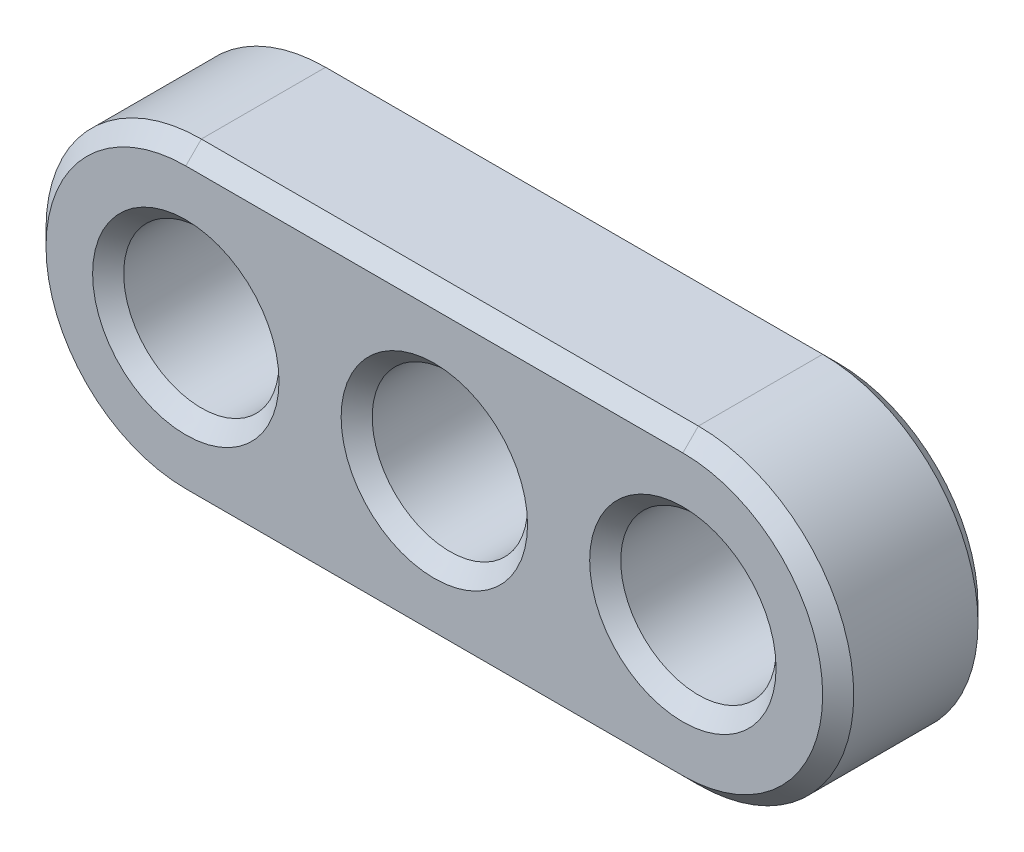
ISO-10303-21;
HEADER;
FILE_DESCRIPTION(('STEP AP214'),'2;1');
FILE_NAME('part.step','',(''),(''),'','','');
FILE_SCHEMA(('AUTOMOTIVE_DESIGN { 1 0 10303 214 1 1 1 1 }'));
ENDSEC;
DATA;
#1=APPLICATION_CONTEXT('core data for automotive mechanical design processes');
#2=APPLICATION_PROTOCOL_DEFINITION('international standard','automotive_design',2000,#1);
#3=PRODUCT_CONTEXT('',#1,'mechanical');
#4=PRODUCT('Part','Part','',(#3));
#5=PRODUCT_RELATED_PRODUCT_CATEGORY('part','',(#4));
#6=PRODUCT_DEFINITION_FORMATION('','',#4);
#7=PRODUCT_DEFINITION_CONTEXT('part definition',#1,'design');
#8=PRODUCT_DEFINITION('design','',#6,#7);
#9=PRODUCT_DEFINITION_SHAPE('','',#8);
#10=(LENGTH_UNIT() NAMED_UNIT(*) SI_UNIT(.MILLI.,.METRE.));
#11=(NAMED_UNIT(*) PLANE_ANGLE_UNIT() SI_UNIT($,.RADIAN.));
#12=(NAMED_UNIT(*) SI_UNIT($,.STERADIAN.) SOLID_ANGLE_UNIT());
#13=UNCERTAINTY_MEASURE_WITH_UNIT(LENGTH_MEASURE(1.E-05),#10,'distance_accuracy_value','');
#14=(GEOMETRIC_REPRESENTATION_CONTEXT(3) GLOBAL_UNCERTAINTY_ASSIGNED_CONTEXT((#13)) GLOBAL_UNIT_ASSIGNED_CONTEXT((#10,
#11,#12)) REPRESENTATION_CONTEXT('',''));
#15=CARTESIAN_POINT('',(0.,0.,0.));
#16=DIRECTION('',(0.,0.,1.));
#17=DIRECTION('',(1.,0.,0.));
#18=AXIS2_PLACEMENT_3D('',#15,#16,#17);
#19=CARTESIAN_POINT('',(12.,0.,7.5));
#20=DIRECTION('',(0.,0.,1.));
#21=DIRECTION('',(1.,0.,0.));
#22=AXIS2_PLACEMENT_3D('',#19,#20,#21);
#23=PLANE('',#22);
#24=CARTESIAN_POINT('',(12.,0.,7.5));
#25=DIRECTION('',(0.,0.,1.));
#26=DIRECTION('',(1.,0.,0.));
#27=AXIS2_PLACEMENT_3D('',#24,#25,#26);
#28=CIRCLE('',#27,4.5);
#29=CARTESIAN_POINT('',(16.5,0.,7.5));
#30=VERTEX_POINT('',#29);
#31=EDGE_CURVE('E11',#30,#30,#28,.F.);
#32=ORIENTED_EDGE('',*,*,#31,.T.);
#33=EDGE_LOOP('',(#32));
#34=FACE_BOUND('',#33,.T.);
#35=CARTESIAN_POINT('',(-12.,0.,7.5));
#36=DIRECTION('',(0.,0.,1.));
#37=DIRECTION('',(1.,0.,0.));
#38=AXIS2_PLACEMENT_3D('',#35,#36,#37);
#39=CIRCLE('',#38,4.5);
#40=CARTESIAN_POINT('',(-7.5,0.,7.5));
#41=VERTEX_POINT('',#40);
#42=EDGE_CURVE('E41',#41,#41,#39,.F.);
#43=ORIENTED_EDGE('',*,*,#42,.T.);
#44=EDGE_LOOP('',(#43));
#45=FACE_BOUND('',#44,.T.);
#46=CARTESIAN_POINT('',(-12.,0.,7.5));
#47=DIRECTION('',(0.,0.,1.));
#48=DIRECTION('',(1.,0.,0.));
#49=AXIS2_PLACEMENT_3D('',#46,#47,#48);
#50=CIRCLE('',#49,6.75);
#51=CARTESIAN_POINT('',(-12.,6.74999999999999,7.5));
#52=VERTEX_POINT('',#51);
#53=CARTESIAN_POINT('',(-12.,-6.75,7.5));
#54=VERTEX_POINT('',#53);
#55=EDGE_CURVE('E49',#52,#54,#50,.T.);
#56=ORIENTED_EDGE('',*,*,#55,.T.);
#57=DIRECTION('',(1.,0.,0.));
#58=VECTOR('',#57,1.);
#59=CARTESIAN_POINT('',(12.,-6.74999999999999,7.5));
#60=LINE('',#59,#58);
#61=CARTESIAN_POINT('',(12.,-6.75,7.5));
#62=VERTEX_POINT('',#61);
#63=EDGE_CURVE('E180',#54,#62,#60,.T.);
#64=ORIENTED_EDGE('',*,*,#63,.T.);
#65=CARTESIAN_POINT('',(12.,0.,7.5));
#66=DIRECTION('',(0.,0.,1.));
#67=DIRECTION('',(1.,0.,0.));
#68=AXIS2_PLACEMENT_3D('',#65,#66,#67);
#69=CIRCLE('',#68,6.75);
#70=CARTESIAN_POINT('',(12.,6.75,7.5));
#71=VERTEX_POINT('',#70);
#72=EDGE_CURVE('E176',#62,#71,#69,.T.);
#73=ORIENTED_EDGE('',*,*,#72,.T.);
#74=DIRECTION('',(-1.,0.,0.));
#75=VECTOR('',#74,1.);
#76=CARTESIAN_POINT('',(-12.,6.74999999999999,7.5));
#77=LINE('',#76,#75);
#78=EDGE_CURVE('E54',#71,#52,#77,.T.);
#79=ORIENTED_EDGE('',*,*,#78,.T.);
#80=EDGE_LOOP('',(#56,#64,#73,#79));
#81=FACE_BOUND('',#80,.T.);
#82=CARTESIAN_POINT('',(0.,0.,7.5));
#83=DIRECTION('',(0.,0.,1.));
#84=DIRECTION('',(1.,0.,0.));
#85=AXIS2_PLACEMENT_3D('',#82,#83,#84);
#86=CIRCLE('',#85,4.5);
#87=CARTESIAN_POINT('',(4.5,0.,7.5));
#88=VERTEX_POINT('',#87);
#89=EDGE_CURVE('E173',#88,#88,#86,.F.);
#90=ORIENTED_EDGE('',*,*,#89,.T.);
#91=EDGE_LOOP('',(#90));
#92=FACE_BOUND('',#91,.T.);
#93=ADVANCED_FACE('F32',(#34,#45,#81,#92),#23,.T.);
#94=CARTESIAN_POINT('',(12.,0.,0.));
#95=DIRECTION('',(0.,0.,1.));
#96=DIRECTION('',(1.,0.,0.));
#97=AXIS2_PLACEMENT_3D('',#94,#95,#96);
#98=PLANE('',#97);
#99=CARTESIAN_POINT('',(12.,0.,0.));
#100=DIRECTION('',(0.,0.,1.));
#101=DIRECTION('',(1.,0.,0.));
#102=AXIS2_PLACEMENT_3D('',#99,#100,#101);
#103=CIRCLE('',#102,4.5);
#104=CARTESIAN_POINT('',(16.5,0.,0.));
#105=VERTEX_POINT('',#104);
#106=EDGE_CURVE('E136',#105,#105,#103,.T.);
#107=ORIENTED_EDGE('',*,*,#106,.T.);
#108=EDGE_LOOP('',(#107));
#109=FACE_BOUND('',#108,.T.);
#110=CARTESIAN_POINT('',(0.,0.,0.));
#111=DIRECTION('',(0.,0.,1.));
#112=DIRECTION('',(1.,0.,0.));
#113=AXIS2_PLACEMENT_3D('',#110,#111,#112);
#114=CIRCLE('',#113,4.50000000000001);
#115=CARTESIAN_POINT('',(4.50000000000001,0.,0.));
#116=VERTEX_POINT('',#115);
#117=EDGE_CURVE('E129',#116,#116,#114,.T.);
#118=ORIENTED_EDGE('',*,*,#117,.T.);
#119=EDGE_LOOP('',(#118));
#120=FACE_BOUND('',#119,.T.);
#121=CARTESIAN_POINT('',(-12.,0.,0.));
#122=DIRECTION('',(0.,0.,1.));
#123=DIRECTION('',(1.,0.,0.));
#124=AXIS2_PLACEMENT_3D('',#121,#122,#123);
#125=CIRCLE('',#124,4.5);
#126=CARTESIAN_POINT('',(-7.5,0.,0.));
#127=VERTEX_POINT('',#126);
#128=EDGE_CURVE('E126',#127,#127,#125,.T.);
#129=ORIENTED_EDGE('',*,*,#128,.T.);
#130=EDGE_LOOP('',(#129));
#131=FACE_BOUND('',#130,.T.);
#132=CARTESIAN_POINT('',(-12.,0.,0.));
#133=DIRECTION('',(0.,0.,1.));
#134=DIRECTION('',(1.,0.,0.));
#135=AXIS2_PLACEMENT_3D('',#132,#133,#134);
#136=CIRCLE('',#135,6.74999999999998);
#137=CARTESIAN_POINT('',(-12.,-6.74999999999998,0.));
#138=VERTEX_POINT('',#137);
#139=CARTESIAN_POINT('',(-12.,6.74999999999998,0.));
#140=VERTEX_POINT('',#139);
#141=EDGE_CURVE('E125',#138,#140,#136,.F.);
#142=ORIENTED_EDGE('',*,*,#141,.T.);
#143=DIRECTION('',(1.,0.,0.));
#144=VECTOR('',#143,1.);
#145=CARTESIAN_POINT('',(12.,6.74999999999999,0.));
#146=LINE('',#145,#144);
#147=CARTESIAN_POINT('',(12.,6.74999999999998,0.));
#148=VERTEX_POINT('',#147);
#149=EDGE_CURVE('E104',#140,#148,#146,.T.);
#150=ORIENTED_EDGE('',*,*,#149,.T.);
#151=CARTESIAN_POINT('',(12.,0.,0.));
#152=DIRECTION('',(0.,0.,1.));
#153=DIRECTION('',(1.,0.,0.));
#154=AXIS2_PLACEMENT_3D('',#151,#152,#153);
#155=CIRCLE('',#154,6.74999999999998);
#156=CARTESIAN_POINT('',(12.,-6.74999999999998,0.));
#157=VERTEX_POINT('',#156);
#158=EDGE_CURVE('E114',#148,#157,#155,.F.);
#159=ORIENTED_EDGE('',*,*,#158,.T.);
#160=DIRECTION('',(-1.,0.,0.));
#161=VECTOR('',#160,1.);
#162=CARTESIAN_POINT('',(12.,-6.74999999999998,0.));
#163=LINE('',#162,#161);
#164=EDGE_CURVE('E120',#157,#138,#163,.T.);
#165=ORIENTED_EDGE('',*,*,#164,.T.);
#166=EDGE_LOOP('',(#142,#150,#159,#165));
#167=FACE_BOUND('',#166,.T.);
#168=ADVANCED_FACE('F123',(#109,#120,#131,#167),#98,.F.);
#169=CARTESIAN_POINT('',(12.,0.,7.5));
#170=DIRECTION('',(0.,0.,-1.));
#171=DIRECTION('',(-1.,0.,0.));
#172=AXIS2_PLACEMENT_3D('',#169,#170,#171);
#173=CYLINDRICAL_SURFACE('',#172,7.5);
#174=DIRECTION('',(0.,0.,-1.));
#175=VECTOR('',#174,1.);
#176=CARTESIAN_POINT('',(12.,-7.49999999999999,7.5));
#177=LINE('',#176,#175);
#178=CARTESIAN_POINT('',(12.,-7.49999999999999,6.75));
#179=VERTEX_POINT('',#178);
#180=CARTESIAN_POINT('',(12.,-7.49999999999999,0.750000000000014));
#181=VERTEX_POINT('',#180);
#182=EDGE_CURVE('E188',#179,#181,#177,.T.);
#183=ORIENTED_EDGE('',*,*,#182,.T.);
#184=CARTESIAN_POINT('',(12.,0.,0.750000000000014));
#185=DIRECTION('',(0.,0.,1.));
#186=DIRECTION('',(1.,0.,0.));
#187=AXIS2_PLACEMENT_3D('',#184,#185,#186);
#188=CIRCLE('',#187,7.5);
#189=CARTESIAN_POINT('',(12.,7.5,0.750000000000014));
#190=VERTEX_POINT('',#189);
#191=EDGE_CURVE('E171',#181,#190,#188,.T.);
#192=ORIENTED_EDGE('',*,*,#191,.T.);
#193=DIRECTION('',(0.,0.,-1.));
#194=VECTOR('',#193,1.);
#195=CARTESIAN_POINT('',(12.,7.5,7.5));
#196=LINE('',#195,#194);
#197=CARTESIAN_POINT('',(12.,7.5,6.75));
#198=VERTEX_POINT('',#197);
#199=EDGE_CURVE('E121',#198,#190,#196,.T.);
#200=ORIENTED_EDGE('',*,*,#199,.F.);
#201=CARTESIAN_POINT('',(12.,0.,6.75));
#202=DIRECTION('',(0.,0.,1.));
#203=DIRECTION('',(1.,0.,0.));
#204=AXIS2_PLACEMENT_3D('',#201,#202,#203);
#205=CIRCLE('',#204,7.5);
#206=EDGE_CURVE('E169',#198,#179,#205,.F.);
#207=ORIENTED_EDGE('',*,*,#206,.T.);
#208=EDGE_LOOP('',(#183,#192,#200,#207));
#209=FACE_BOUND('',#208,.T.);
#210=ADVANCED_FACE('F214',(#209),#173,.T.);
#211=CARTESIAN_POINT('',(12.,7.5,7.5));
#212=DIRECTION('',(0.,-1.,0.));
#213=DIRECTION('',(1.,0.,0.));
#214=AXIS2_PLACEMENT_3D('',#211,#212,#213);
#215=PLANE('',#214);
#216=ORIENTED_EDGE('',*,*,#199,.T.);
#217=DIRECTION('',(-1.,0.,0.));
#218=VECTOR('',#217,1.);
#219=CARTESIAN_POINT('',(12.,7.5,0.750000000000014));
#220=LINE('',#219,#218);
#221=CARTESIAN_POINT('',(-12.,7.5,0.750000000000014));
#222=VERTEX_POINT('',#221);
#223=EDGE_CURVE('E107',#190,#222,#220,.T.);
#224=ORIENTED_EDGE('',*,*,#223,.T.);
#225=DIRECTION('',(0.,0.,-1.));
#226=VECTOR('',#225,1.);
#227=CARTESIAN_POINT('',(-12.,7.5,7.5));
#228=LINE('',#227,#226);
#229=CARTESIAN_POINT('',(-12.,7.5,6.75));
#230=VERTEX_POINT('',#229);
#231=EDGE_CURVE('E211',#230,#222,#228,.T.);
#232=ORIENTED_EDGE('',*,*,#231,.F.);
#233=DIRECTION('',(1.,0.,0.));
#234=VECTOR('',#233,1.);
#235=CARTESIAN_POINT('',(12.,7.5,6.75));
#236=LINE('',#235,#234);
#237=EDGE_CURVE('E157',#230,#198,#236,.T.);
#238=ORIENTED_EDGE('',*,*,#237,.T.);
#239=EDGE_LOOP('',(#216,#224,#232,#238));
#240=FACE_BOUND('',#239,.T.);
#241=ADVANCED_FACE('F209',(#240),#215,.F.);
#242=CARTESIAN_POINT('',(-12.,0.,7.5));
#243=DIRECTION('',(0.,0.,-1.));
#244=DIRECTION('',(-1.,0.,0.));
#245=AXIS2_PLACEMENT_3D('',#242,#243,#244);
#246=CYLINDRICAL_SURFACE('',#245,7.5);
#247=ORIENTED_EDGE('',*,*,#231,.T.);
#248=CARTESIAN_POINT('',(-12.,0.,0.750000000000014));
#249=DIRECTION('',(0.,0.,1.));
#250=DIRECTION('',(1.,0.,0.));
#251=AXIS2_PLACEMENT_3D('',#248,#249,#250);
#252=CIRCLE('',#251,7.5);
#253=CARTESIAN_POINT('',(-12.,-7.5,0.750000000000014));
#254=VERTEX_POINT('',#253);
#255=EDGE_CURVE('E162',#222,#254,#252,.T.);
#256=ORIENTED_EDGE('',*,*,#255,.T.);
#257=DIRECTION('',(0.,0.,-1.));
#258=VECTOR('',#257,1.);
#259=CARTESIAN_POINT('',(-12.,-7.5,7.5));
#260=LINE('',#259,#258);
#261=CARTESIAN_POINT('',(-12.,-7.5,6.75));
#262=VERTEX_POINT('',#261);
#263=EDGE_CURVE('E217',#262,#254,#260,.T.);
#264=ORIENTED_EDGE('',*,*,#263,.F.);
#265=CARTESIAN_POINT('',(-12.,0.,6.75));
#266=DIRECTION('',(0.,0.,1.));
#267=DIRECTION('',(1.,0.,0.));
#268=AXIS2_PLACEMENT_3D('',#265,#266,#267);
#269=CIRCLE('',#268,7.5);
#270=EDGE_CURVE('E160',#262,#230,#269,.F.);
#271=ORIENTED_EDGE('',*,*,#270,.T.);
#272=EDGE_LOOP('',(#247,#256,#264,#271));
#273=FACE_BOUND('',#272,.T.);
#274=ADVANCED_FACE('F230',(#273),#246,.T.);
#275=CARTESIAN_POINT('',(12.,-7.49999999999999,7.5));
#276=DIRECTION('',(0.,1.,0.));
#277=DIRECTION('',(-1.,0.,0.));
#278=AXIS2_PLACEMENT_3D('',#275,#276,#277);
#279=PLANE('',#278);
#280=ORIENTED_EDGE('',*,*,#263,.T.);
#281=DIRECTION('',(1.,0.,0.));
#282=VECTOR('',#281,1.);
#283=CARTESIAN_POINT('',(12.,-7.49999999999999,0.750000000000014));
#284=LINE('',#283,#282);
#285=EDGE_CURVE('E167',#254,#181,#284,.T.);
#286=ORIENTED_EDGE('',*,*,#285,.T.);
#287=ORIENTED_EDGE('',*,*,#182,.F.);
#288=DIRECTION('',(-1.,0.,0.));
#289=VECTOR('',#288,1.);
#290=CARTESIAN_POINT('',(-12.,-7.5,6.75));
#291=LINE('',#290,#289);
#292=EDGE_CURVE('E164',#179,#262,#291,.T.);
#293=ORIENTED_EDGE('',*,*,#292,.T.);
#294=EDGE_LOOP('',(#280,#286,#287,#293));
#295=FACE_BOUND('',#294,.T.);
#296=ADVANCED_FACE('F234',(#295),#279,.F.);
#297=CARTESIAN_POINT('',(-12.,0.,7.5));
#298=DIRECTION('',(0.,0.,-1.));
#299=DIRECTION('',(-1.,0.,0.));
#300=AXIS2_PLACEMENT_3D('',#297,#298,#299);
#301=CYLINDRICAL_SURFACE('',#300,3.75);
#302=CARTESIAN_POINT('',(-12.,0.,0.750000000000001));
#303=DIRECTION('',(0.,0.,1.));
#304=DIRECTION('',(1.,0.,0.));
#305=AXIS2_PLACEMENT_3D('',#302,#303,#304);
#306=CIRCLE('',#305,3.75);
#307=CARTESIAN_POINT('',(-8.25,0.,0.750000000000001));
#308=VERTEX_POINT('',#307);
#309=EDGE_CURVE('E154',#308,#308,#306,.F.);
#310=ORIENTED_EDGE('',*,*,#309,.T.);
#311=EDGE_LOOP('',(#310));
#312=FACE_BOUND('',#311,.T.);
#313=CARTESIAN_POINT('',(-12.,0.,6.75));
#314=DIRECTION('',(0.,0.,1.));
#315=DIRECTION('',(1.,0.,0.));
#316=AXIS2_PLACEMENT_3D('',#313,#314,#315);
#317=CIRCLE('',#316,3.75);
#318=CARTESIAN_POINT('',(-8.25,0.,6.75));
#319=VERTEX_POINT('',#318);
#320=EDGE_CURVE('E151',#319,#319,#317,.T.);
#321=ORIENTED_EDGE('',*,*,#320,.T.);
#322=EDGE_LOOP('',(#321));
#323=FACE_BOUND('',#322,.T.);
#324=ADVANCED_FACE('F253',(#312,#323),#301,.F.);
#325=CARTESIAN_POINT('',(0.,0.,7.5));
#326=DIRECTION('',(0.,0.,-1.));
#327=DIRECTION('',(-1.,0.,0.));
#328=AXIS2_PLACEMENT_3D('',#325,#326,#327);
#329=CYLINDRICAL_SURFACE('',#328,3.75);
#330=CARTESIAN_POINT('',(0.,0.,0.750000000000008));
#331=DIRECTION('',(0.,0.,1.));
#332=DIRECTION('',(1.,0.,0.));
#333=AXIS2_PLACEMENT_3D('',#330,#331,#332);
#334=CIRCLE('',#333,3.75);
#335=CARTESIAN_POINT('',(3.75,0.,0.750000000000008));
#336=VERTEX_POINT('',#335);
#337=EDGE_CURVE('E148',#336,#336,#334,.F.);
#338=ORIENTED_EDGE('',*,*,#337,.T.);
#339=EDGE_LOOP('',(#338));
#340=FACE_BOUND('',#339,.T.);
#341=CARTESIAN_POINT('',(0.,0.,6.75));
#342=DIRECTION('',(0.,0.,1.));
#343=DIRECTION('',(1.,0.,0.));
#344=AXIS2_PLACEMENT_3D('',#341,#342,#343);
#345=CIRCLE('',#344,3.75);
#346=CARTESIAN_POINT('',(3.75,0.,6.75));
#347=VERTEX_POINT('',#346);
#348=EDGE_CURVE('E145',#347,#347,#345,.T.);
#349=ORIENTED_EDGE('',*,*,#348,.T.);
#350=EDGE_LOOP('',(#349));
#351=FACE_BOUND('',#350,.T.);
#352=ADVANCED_FACE('F250',(#340,#351),#329,.F.);
#353=CARTESIAN_POINT('',(12.,0.,7.5));
#354=DIRECTION('',(0.,0.,-1.));
#355=DIRECTION('',(-1.,0.,0.));
#356=AXIS2_PLACEMENT_3D('',#353,#354,#355);
#357=CYLINDRICAL_SURFACE('',#356,3.75);
#358=CARTESIAN_POINT('',(12.,0.,0.750000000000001));
#359=DIRECTION('',(0.,0.,1.));
#360=DIRECTION('',(1.,0.,0.));
#361=AXIS2_PLACEMENT_3D('',#358,#359,#360);
#362=CIRCLE('',#361,3.75);
#363=CARTESIAN_POINT('',(15.75,0.,0.750000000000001));
#364=VERTEX_POINT('',#363);
#365=EDGE_CURVE('E142',#364,#364,#362,.F.);
#366=ORIENTED_EDGE('',*,*,#365,.T.);
#367=EDGE_LOOP('',(#366));
#368=FACE_BOUND('',#367,.T.);
#369=CARTESIAN_POINT('',(12.,0.,6.75));
#370=DIRECTION('',(0.,0.,1.));
#371=DIRECTION('',(1.,0.,0.));
#372=AXIS2_PLACEMENT_3D('',#369,#370,#371);
#373=CIRCLE('',#372,3.75);
#374=CARTESIAN_POINT('',(15.75,0.,6.75));
#375=VERTEX_POINT('',#374);
#376=EDGE_CURVE('E139',#375,#375,#373,.T.);
#377=ORIENTED_EDGE('',*,*,#376,.T.);
#378=EDGE_LOOP('',(#377));
#379=FACE_BOUND('',#378,.T.);
#380=ADVANCED_FACE('F252',(#368,#379),#357,.F.);
#381=CARTESIAN_POINT('',(12.,0.,0.));
#382=DIRECTION('',(0.,0.,-1.));
#383=DIRECTION('',(-1.,0.,0.));
#384=AXIS2_PLACEMENT_3D('',#381,#382,#383);
#385=CONICAL_SURFACE('',#384,4.5,0.785398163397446);
#386=ORIENTED_EDGE('',*,*,#365,.F.);
#387=EDGE_LOOP('',(#386));
#388=FACE_BOUND('',#387,.T.);
#389=ORIENTED_EDGE('',*,*,#106,.F.);
#390=EDGE_LOOP('',(#389));
#391=FACE_BOUND('',#390,.T.);
#392=ADVANCED_FACE('F260',(#388,#391),#385,.F.);
#393=CARTESIAN_POINT('',(0.,0.,0.));
#394=DIRECTION('',(0.,0.,-1.));
#395=DIRECTION('',(-1.,0.,0.));
#396=AXIS2_PLACEMENT_3D('',#393,#394,#395);
#397=CONICAL_SURFACE('',#396,4.50000000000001,0.785398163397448);
#398=ORIENTED_EDGE('',*,*,#337,.F.);
#399=EDGE_LOOP('',(#398));
#400=FACE_BOUND('',#399,.T.);
#401=ORIENTED_EDGE('',*,*,#117,.F.);
#402=EDGE_LOOP('',(#401));
#403=FACE_BOUND('',#402,.T.);
#404=ADVANCED_FACE('F279',(#400,#403),#397,.F.);
#405=CARTESIAN_POINT('',(-12.,0.,0.));
#406=DIRECTION('',(0.,0.,-1.));
#407=DIRECTION('',(-1.,0.,0.));
#408=AXIS2_PLACEMENT_3D('',#405,#406,#407);
#409=CONICAL_SURFACE('',#408,4.5,0.785398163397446);
#410=ORIENTED_EDGE('',*,*,#309,.F.);
#411=EDGE_LOOP('',(#410));
#412=FACE_BOUND('',#411,.T.);
#413=ORIENTED_EDGE('',*,*,#128,.F.);
#414=EDGE_LOOP('',(#413));
#415=FACE_BOUND('',#414,.T.);
#416=ADVANCED_FACE('F283',(#412,#415),#409,.F.);
#417=CARTESIAN_POINT('',(12.,-7.49999999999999,0.750000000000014));
#418=DIRECTION('',(0.,0.707106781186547,0.707106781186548));
#419=DIRECTION('',(1.,0.,0.));
#420=AXIS2_PLACEMENT_3D('',#417,#418,#419);
#421=PLANE('',#420);
#422=DIRECTION('',(0.,-0.707106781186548,0.707106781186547));
#423=VECTOR('',#422,1.);
#424=CARTESIAN_POINT('',(-12.,-6.74999999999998,0.));
#425=LINE('',#424,#423);
#426=EDGE_CURVE('E110',#138,#254,#425,.T.);
#427=ORIENTED_EDGE('',*,*,#426,.F.);
#428=ORIENTED_EDGE('',*,*,#164,.F.);
#429=DIRECTION('',(0.,0.707106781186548,-0.707106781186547));
#430=VECTOR('',#429,1.);
#431=CARTESIAN_POINT('',(12.,-7.49999999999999,0.750000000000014));
#432=LINE('',#431,#430);
#433=EDGE_CURVE('E117',#181,#157,#432,.T.);
#434=ORIENTED_EDGE('',*,*,#433,.F.);
#435=ORIENTED_EDGE('',*,*,#285,.F.);
#436=EDGE_LOOP('',(#427,#428,#434,#435));
#437=FACE_BOUND('',#436,.T.);
#438=ADVANCED_FACE('F223',(#437),#421,.F.);
#439=CARTESIAN_POINT('',(12.,0.,0.750000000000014));
#440=DIRECTION('',(0.,0.,1.));
#441=DIRECTION('',(1.,0.,0.));
#442=AXIS2_PLACEMENT_3D('',#439,#440,#441);
#443=CONICAL_SURFACE('',#442,7.5,0.785398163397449);
#444=ORIENTED_EDGE('',*,*,#433,.T.);
#445=ORIENTED_EDGE('',*,*,#158,.F.);
#446=DIRECTION('',(0.,-0.707106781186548,-0.707106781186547));
#447=VECTOR('',#446,1.);
#448=CARTESIAN_POINT('',(12.,7.5,0.750000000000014));
#449=LINE('',#448,#447);
#450=EDGE_CURVE('E100',#190,#148,#449,.T.);
#451=ORIENTED_EDGE('',*,*,#450,.F.);
#452=ORIENTED_EDGE('',*,*,#191,.F.);
#453=EDGE_LOOP('',(#444,#445,#451,#452));
#454=FACE_BOUND('',#453,.T.);
#455=ADVANCED_FACE('F115',(#454),#443,.T.);
#456=CARTESIAN_POINT('',(-12.,0.,0.750000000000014));
#457=DIRECTION('',(0.,0.,1.));
#458=DIRECTION('',(1.,0.,0.));
#459=AXIS2_PLACEMENT_3D('',#456,#457,#458);
#460=CONICAL_SURFACE('',#459,7.5,0.785398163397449);
#461=ORIENTED_EDGE('',*,*,#426,.T.);
#462=ORIENTED_EDGE('',*,*,#255,.F.);
#463=DIRECTION('',(0.,0.707106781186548,0.707106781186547));
#464=VECTOR('',#463,1.);
#465=CARTESIAN_POINT('',(-12.,6.74999999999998,0.));
#466=LINE('',#465,#464);
#467=EDGE_CURVE('E111',#140,#222,#466,.T.);
#468=ORIENTED_EDGE('',*,*,#467,.F.);
#469=ORIENTED_EDGE('',*,*,#141,.F.);
#470=EDGE_LOOP('',(#461,#462,#468,#469));
#471=FACE_BOUND('',#470,.T.);
#472=ADVANCED_FACE('F226',(#471),#460,.T.);
#473=CARTESIAN_POINT('',(12.,7.5,0.750000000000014));
#474=DIRECTION('',(0.,-0.707106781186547,0.707106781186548));
#475=DIRECTION('',(-1.,0.,0.));
#476=AXIS2_PLACEMENT_3D('',#473,#474,#475);
#477=PLANE('',#476);
#478=ORIENTED_EDGE('',*,*,#450,.T.);
#479=ORIENTED_EDGE('',*,*,#149,.F.);
#480=ORIENTED_EDGE('',*,*,#467,.T.);
#481=ORIENTED_EDGE('',*,*,#223,.F.);
#482=EDGE_LOOP('',(#478,#479,#480,#481));
#483=FACE_BOUND('',#482,.T.);
#484=ADVANCED_FACE('F102',(#483),#477,.F.);
#485=CARTESIAN_POINT('',(12.,0.,6.75));
#486=DIRECTION('',(0.,0.,1.));
#487=DIRECTION('',(1.,0.,0.));
#488=AXIS2_PLACEMENT_3D('',#485,#486,#487);
#489=CONICAL_SURFACE('',#488,3.75,0.785398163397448);
#490=ORIENTED_EDGE('',*,*,#31,.F.);
#491=EDGE_LOOP('',(#490));
#492=FACE_BOUND('',#491,.T.);
#493=ORIENTED_EDGE('',*,*,#376,.F.);
#494=EDGE_LOOP('',(#493));
#495=FACE_BOUND('',#494,.T.);
#496=ADVANCED_FACE('F290',(#492,#495),#489,.F.);
#497=CARTESIAN_POINT('',(-12.,0.,6.75));
#498=DIRECTION('',(0.,0.,1.));
#499=DIRECTION('',(1.,0.,0.));
#500=AXIS2_PLACEMENT_3D('',#497,#498,#499);
#501=CONICAL_SURFACE('',#500,3.75,0.785398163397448);
#502=ORIENTED_EDGE('',*,*,#42,.F.);
#503=EDGE_LOOP('',(#502));
#504=FACE_BOUND('',#503,.T.);
#505=ORIENTED_EDGE('',*,*,#320,.F.);
#506=EDGE_LOOP('',(#505));
#507=FACE_BOUND('',#506,.T.);
#508=ADVANCED_FACE('F299',(#504,#507),#501,.F.);
#509=CARTESIAN_POINT('',(12.,6.75,7.5));
#510=DIRECTION('',(0.,0.707106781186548,0.707106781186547));
#511=DIRECTION('',(1.,0.,0.));
#512=AXIS2_PLACEMENT_3D('',#509,#510,#511);
#513=PLANE('',#512);
#514=DIRECTION('',(0.,-0.707106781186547,0.707106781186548));
#515=VECTOR('',#514,1.);
#516=CARTESIAN_POINT('',(12.,7.5,6.75));
#517=LINE('',#516,#515);
#518=EDGE_CURVE('E192',#198,#71,#517,.T.);
#519=ORIENTED_EDGE('',*,*,#518,.F.);
#520=ORIENTED_EDGE('',*,*,#237,.F.);
#521=DIRECTION('',(0.,0.707106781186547,-0.707106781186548));
#522=VECTOR('',#521,1.);
#523=CARTESIAN_POINT('',(-12.,6.74999999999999,7.5));
#524=LINE('',#523,#522);
#525=EDGE_CURVE('E36',#52,#230,#524,.T.);
#526=ORIENTED_EDGE('',*,*,#525,.F.);
#527=ORIENTED_EDGE('',*,*,#78,.F.);
#528=EDGE_LOOP('',(#519,#520,#526,#527));
#529=FACE_BOUND('',#528,.T.);
#530=ADVANCED_FACE('F204',(#529),#513,.T.);
#531=CARTESIAN_POINT('',(-12.,0.,7.5));
#532=DIRECTION('',(0.,0.,-1.));
#533=DIRECTION('',(-1.,0.,0.));
#534=AXIS2_PLACEMENT_3D('',#531,#532,#533);
#535=CONICAL_SURFACE('',#534,6.75,0.785398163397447);
#536=ORIENTED_EDGE('',*,*,#525,.T.);
#537=ORIENTED_EDGE('',*,*,#270,.F.);
#538=DIRECTION('',(0.,-0.707106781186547,-0.707106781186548));
#539=VECTOR('',#538,1.);
#540=CARTESIAN_POINT('',(-12.,-6.75,7.5));
#541=LINE('',#540,#539);
#542=EDGE_CURVE('E191',#54,#262,#541,.T.);
#543=ORIENTED_EDGE('',*,*,#542,.F.);
#544=ORIENTED_EDGE('',*,*,#55,.F.);
#545=EDGE_LOOP('',(#536,#537,#543,#544));
#546=FACE_BOUND('',#545,.T.);
#547=ADVANCED_FACE('F201',(#546),#535,.T.);
#548=CARTESIAN_POINT('',(12.,0.,7.5));
#549=DIRECTION('',(0.,0.,-1.));
#550=DIRECTION('',(-1.,0.,0.));
#551=AXIS2_PLACEMENT_3D('',#548,#549,#550);
#552=CONICAL_SURFACE('',#551,6.75,0.785398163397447);
#553=ORIENTED_EDGE('',*,*,#518,.T.);
#554=ORIENTED_EDGE('',*,*,#72,.F.);
#555=DIRECTION('',(0.,0.707106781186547,0.707106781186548));
#556=VECTOR('',#555,1.);
#557=CARTESIAN_POINT('',(12.,-7.5,6.75));
#558=LINE('',#557,#556);
#559=EDGE_CURVE('E189',#179,#62,#558,.T.);
#560=ORIENTED_EDGE('',*,*,#559,.F.);
#561=ORIENTED_EDGE('',*,*,#206,.F.);
#562=EDGE_LOOP('',(#553,#554,#560,#561));
#563=FACE_BOUND('',#562,.T.);
#564=ADVANCED_FACE('F239',(#563),#552,.T.);
#565=CARTESIAN_POINT('',(12.,-6.74999999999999,7.5));
#566=DIRECTION('',(0.,-0.707106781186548,0.707106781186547));
#567=DIRECTION('',(-1.,0.,0.));
#568=AXIS2_PLACEMENT_3D('',#565,#566,#567);
#569=PLANE('',#568);
#570=ORIENTED_EDGE('',*,*,#542,.T.);
#571=ORIENTED_EDGE('',*,*,#292,.F.);
#572=ORIENTED_EDGE('',*,*,#559,.T.);
#573=ORIENTED_EDGE('',*,*,#63,.F.);
#574=EDGE_LOOP('',(#570,#571,#572,#573));
#575=FACE_BOUND('',#574,.T.);
#576=ADVANCED_FACE('F237',(#575),#569,.T.);
#577=CARTESIAN_POINT('',(0.,0.,6.75));
#578=DIRECTION('',(0.,0.,1.));
#579=DIRECTION('',(1.,0.,0.));
#580=AXIS2_PLACEMENT_3D('',#577,#578,#579);
#581=CONICAL_SURFACE('',#580,3.75,0.785398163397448);
#582=ORIENTED_EDGE('',*,*,#89,.F.);
#583=EDGE_LOOP('',(#582));
#584=FACE_BOUND('',#583,.T.);
#585=ORIENTED_EDGE('',*,*,#348,.F.);
#586=EDGE_LOOP('',(#585));
#587=FACE_BOUND('',#586,.T.);
#588=ADVANCED_FACE('F34',(#584,#587),#581,.F.);
#589=CLOSED_SHELL('',(#93,#168,#210,#241,#274,#296,#324,#352,#380,#392,#404,#416,#438,#455,#472,
#484,#496,#508,#530,#547,#564,#576,#588));
#590=MANIFOLD_SOLID_BREP('B2',#589);
#591=ADVANCED_BREP_SHAPE_REPRESENTATION('',(#18,#590),#14);
#592=SHAPE_DEFINITION_REPRESENTATION(#9,#591);
ENDSEC;
END-ISO-10303-21;
